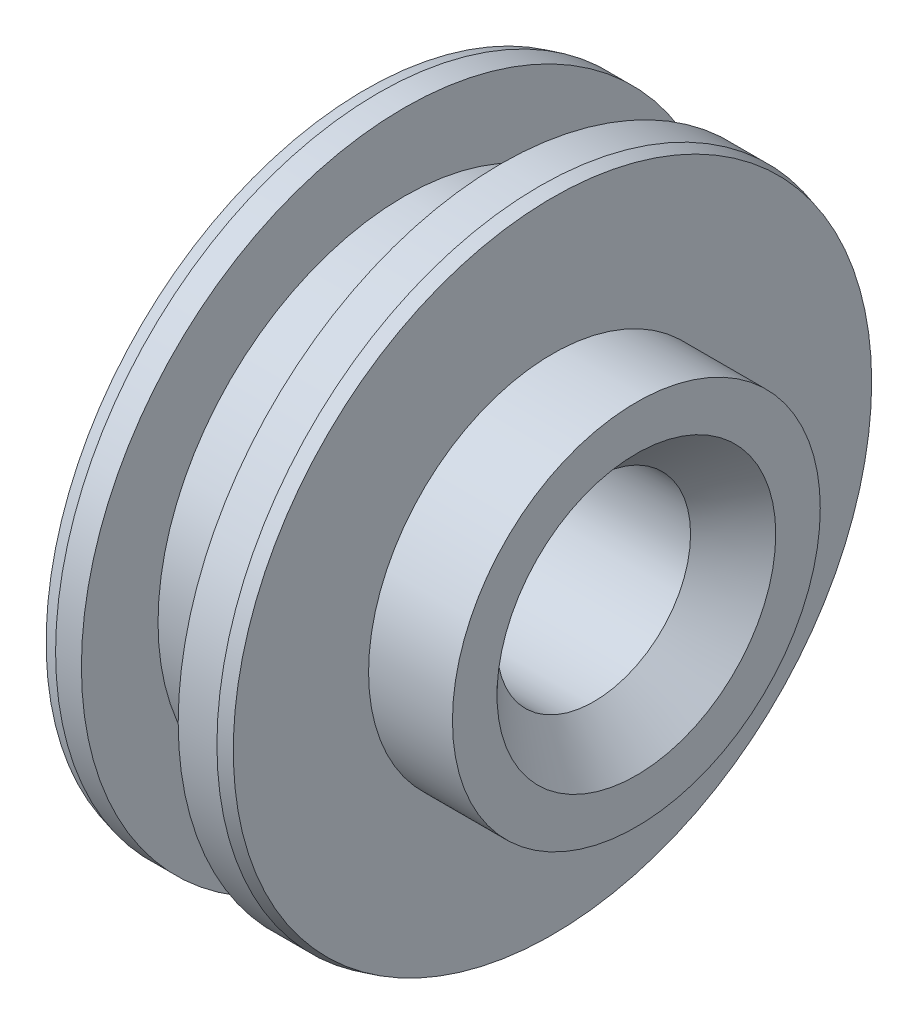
ISO-10303-21;
HEADER;
FILE_DESCRIPTION(('STEP AP214'),'2;1');
FILE_NAME('part.step','',(''),(''),'','','');
FILE_SCHEMA(('AUTOMOTIVE_DESIGN { 1 0 10303 214 1 1 1 1 }'));
ENDSEC;
DATA;
#1=APPLICATION_CONTEXT('core data for automotive mechanical design processes');
#2=APPLICATION_PROTOCOL_DEFINITION('international standard','automotive_design',2000,#1);
#3=PRODUCT_CONTEXT('',#1,'mechanical');
#4=PRODUCT('Part','Part','',(#3));
#5=PRODUCT_RELATED_PRODUCT_CATEGORY('part','',(#4));
#6=PRODUCT_DEFINITION_FORMATION('','',#4);
#7=PRODUCT_DEFINITION_CONTEXT('part definition',#1,'design');
#8=PRODUCT_DEFINITION('design','',#6,#7);
#9=PRODUCT_DEFINITION_SHAPE('','',#8);
#10=(LENGTH_UNIT() NAMED_UNIT(*) SI_UNIT(.MILLI.,.METRE.));
#11=(NAMED_UNIT(*) PLANE_ANGLE_UNIT() SI_UNIT($,.RADIAN.));
#12=(NAMED_UNIT(*) SI_UNIT($,.STERADIAN.) SOLID_ANGLE_UNIT());
#13=UNCERTAINTY_MEASURE_WITH_UNIT(LENGTH_MEASURE(1.E-05),#10,'distance_accuracy_value','');
#14=(GEOMETRIC_REPRESENTATION_CONTEXT(3) GLOBAL_UNCERTAINTY_ASSIGNED_CONTEXT((#13)) GLOBAL_UNIT_ASSIGNED_CONTEXT((#10,
#11,#12)) REPRESENTATION_CONTEXT('',''));
#15=CARTESIAN_POINT('',(0.,0.,0.));
#16=DIRECTION('',(0.,0.,1.));
#17=DIRECTION('',(1.,0.,0.));
#18=AXIS2_PLACEMENT_3D('',#15,#16,#17);
#19=CARTESIAN_POINT('',(0.,0.,0.));
#20=DIRECTION('',(1.,0.,0.));
#21=DIRECTION('',(0.,0.,-1.));
#22=AXIS2_PLACEMENT_3D('',#19,#20,#21);
#23=CYLINDRICAL_SURFACE('',#22,3.);
#24=CARTESIAN_POINT('',(7.08,0.,0.));
#25=DIRECTION('',(1.,0.,0.));
#26=DIRECTION('',(0.,0.,-1.));
#27=AXIS2_PLACEMENT_3D('',#24,#25,#26);
#28=CIRCLE('',#27,3.);
#29=CARTESIAN_POINT('',(7.08,0.,-3.));
#30=VERTEX_POINT('',#29);
#31=EDGE_CURVE('E391',#30,#30,#28,.T.);
#32=ORIENTED_EDGE('',*,*,#31,.T.);
#33=EDGE_LOOP('',(#32));
#34=FACE_BOUND('',#33,.T.);
#35=CARTESIAN_POINT('',(0.,0.,0.));
#36=DIRECTION('',(1.,0.,0.));
#37=DIRECTION('',(0.,0.,-1.));
#38=AXIS2_PLACEMENT_3D('',#35,#36,#37);
#39=CIRCLE('',#38,3.);
#40=CARTESIAN_POINT('',(0.,0.,-3.));
#41=VERTEX_POINT('',#40);
#42=EDGE_CURVE('E10',#41,#41,#39,.T.);
#43=ORIENTED_EDGE('',*,*,#42,.F.);
#44=EDGE_LOOP('',(#43));
#45=FACE_BOUND('',#44,.T.);
#46=ADVANCED_FACE('F348',(#34,#45),#23,.F.);
#47=CARTESIAN_POINT('',(0.,3.,0.));
#48=DIRECTION('',(-1.,0.,0.));
#49=DIRECTION('',(0.,0.,1.));
#50=AXIS2_PLACEMENT_3D('',#47,#48,#49);
#51=PLANE('',#50);
#52=ORIENTED_EDGE('',*,*,#42,.T.);
#53=EDGE_LOOP('',(#52));
#54=FACE_BOUND('',#53,.T.);
#55=CARTESIAN_POINT('',(0.,0.,0.));
#56=DIRECTION('',(1.,0.,0.));
#57=DIRECTION('',(0.,0.,-1.));
#58=AXIS2_PLACEMENT_3D('',#55,#56,#57);
#59=CIRCLE('',#58,9.89282032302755);
#60=CARTESIAN_POINT('',(0.,0.,-9.89282032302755));
#61=VERTEX_POINT('',#60);
#62=EDGE_CURVE('E354',#61,#61,#59,.T.);
#63=ORIENTED_EDGE('',*,*,#62,.F.);
#64=EDGE_LOOP('',(#63));
#65=FACE_BOUND('',#64,.T.);
#66=ADVANCED_FACE('F409',(#54,#65),#51,.T.);
#67=CARTESIAN_POINT('',(0.400000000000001,0.,0.));
#68=DIRECTION('',(1.,0.,0.));
#69=DIRECTION('',(0.,0.,-1.));
#70=AXIS2_PLACEMENT_3D('',#67,#68,#69);
#71=CONICAL_SURFACE('',#70,10.,0.261799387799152);
#72=ORIENTED_EDGE('',*,*,#62,.T.);
#73=EDGE_LOOP('',(#72));
#74=FACE_BOUND('',#73,.T.);
#75=CARTESIAN_POINT('',(0.400000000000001,0.,0.));
#76=DIRECTION('',(1.,0.,0.));
#77=DIRECTION('',(0.,0.,-1.));
#78=AXIS2_PLACEMENT_3D('',#75,#76,#77);
#79=CIRCLE('',#78,10.);
#80=CARTESIAN_POINT('',(0.400000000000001,0.,-10.));
#81=VERTEX_POINT('',#80);
#82=EDGE_CURVE('E358',#81,#81,#79,.T.);
#83=ORIENTED_EDGE('',*,*,#82,.F.);
#84=EDGE_LOOP('',(#83));
#85=FACE_BOUND('',#84,.T.);
#86=ADVANCED_FACE('F413',(#74,#85),#71,.T.);
#87=CARTESIAN_POINT('',(0.,0.,0.));
#88=DIRECTION('',(1.,0.,0.));
#89=DIRECTION('',(0.,0.,-1.));
#90=AXIS2_PLACEMENT_3D('',#87,#88,#89);
#91=CYLINDRICAL_SURFACE('',#90,10.);
#92=ORIENTED_EDGE('',*,*,#82,.T.);
#93=EDGE_LOOP('',(#92));
#94=FACE_BOUND('',#93,.T.);
#95=CARTESIAN_POINT('',(1.2,0.,0.));
#96=DIRECTION('',(1.,0.,0.));
#97=DIRECTION('',(0.,0.,-1.));
#98=AXIS2_PLACEMENT_3D('',#95,#96,#97);
#99=CIRCLE('',#98,10.);
#100=CARTESIAN_POINT('',(1.2,0.,-10.));
#101=VERTEX_POINT('',#100);
#102=EDGE_CURVE('E362',#101,#101,#99,.T.);
#103=ORIENTED_EDGE('',*,*,#102,.F.);
#104=EDGE_LOOP('',(#103));
#105=FACE_BOUND('',#104,.T.);
#106=ADVANCED_FACE('F417',(#94,#105),#91,.T.);
#107=CARTESIAN_POINT('',(1.2,10.,0.));
#108=DIRECTION('',(1.,0.,0.));
#109=DIRECTION('',(0.,0.,-1.));
#110=AXIS2_PLACEMENT_3D('',#107,#108,#109);
#111=PLANE('',#110);
#112=ORIENTED_EDGE('',*,*,#102,.T.);
#113=EDGE_LOOP('',(#112));
#114=FACE_BOUND('',#113,.T.);
#115=CARTESIAN_POINT('',(1.2,0.,0.));
#116=DIRECTION('',(1.,0.,0.));
#117=DIRECTION('',(0.,0.,-1.));
#118=AXIS2_PLACEMENT_3D('',#115,#116,#117);
#119=CIRCLE('',#118,7.625);
#120=CARTESIAN_POINT('',(1.2,0.,-7.625));
#121=VERTEX_POINT('',#120);
#122=EDGE_CURVE('E367',#121,#121,#119,.T.);
#123=ORIENTED_EDGE('',*,*,#122,.F.);
#124=EDGE_LOOP('',(#123));
#125=FACE_BOUND('',#124,.T.);
#126=ADVANCED_FACE('F423',(#114,#125),#111,.T.);
#127=CARTESIAN_POINT('',(0.,0.,0.));
#128=DIRECTION('',(1.,0.,0.));
#129=DIRECTION('',(0.,0.,-1.));
#130=AXIS2_PLACEMENT_3D('',#127,#128,#129);
#131=CYLINDRICAL_SURFACE('',#130,7.625);
#132=ORIENTED_EDGE('',*,*,#122,.T.);
#133=EDGE_LOOP('',(#132));
#134=FACE_BOUND('',#133,.T.);
#135=CARTESIAN_POINT('',(4.2,0.,0.));
#136=DIRECTION('',(1.,0.,0.));
#137=DIRECTION('',(0.,0.,-1.));
#138=AXIS2_PLACEMENT_3D('',#135,#136,#137);
#139=CIRCLE('',#138,7.625);
#140=CARTESIAN_POINT('',(4.2,0.,-7.625));
#141=VERTEX_POINT('',#140);
#142=EDGE_CURVE('E370',#141,#141,#139,.T.);
#143=ORIENTED_EDGE('',*,*,#142,.F.);
#144=EDGE_LOOP('',(#143));
#145=FACE_BOUND('',#144,.T.);
#146=ADVANCED_FACE('F427',(#134,#145),#131,.T.);
#147=CARTESIAN_POINT('',(4.2,7.62499999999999,0.));
#148=DIRECTION('',(-1.,0.,0.));
#149=DIRECTION('',(0.,0.,1.));
#150=AXIS2_PLACEMENT_3D('',#147,#148,#149);
#151=PLANE('',#150);
#152=ORIENTED_EDGE('',*,*,#142,.T.);
#153=EDGE_LOOP('',(#152));
#154=FACE_BOUND('',#153,.T.);
#155=CARTESIAN_POINT('',(4.2,0.,0.));
#156=DIRECTION('',(1.,0.,0.));
#157=DIRECTION('',(0.,0.,-1.));
#158=AXIS2_PLACEMENT_3D('',#155,#156,#157);
#159=CIRCLE('',#158,10.);
#160=CARTESIAN_POINT('',(4.2,0.,-10.));
#161=VERTEX_POINT('',#160);
#162=EDGE_CURVE('E373',#161,#161,#159,.T.);
#163=ORIENTED_EDGE('',*,*,#162,.F.);
#164=EDGE_LOOP('',(#163));
#165=FACE_BOUND('',#164,.T.);
#166=ADVANCED_FACE('F431',(#154,#165),#151,.T.);
#167=CARTESIAN_POINT('',(0.,0.,0.));
#168=DIRECTION('',(1.,0.,0.));
#169=DIRECTION('',(0.,0.,-1.));
#170=AXIS2_PLACEMENT_3D('',#167,#168,#169);
#171=CYLINDRICAL_SURFACE('',#170,10.);
#172=ORIENTED_EDGE('',*,*,#162,.T.);
#173=EDGE_LOOP('',(#172));
#174=FACE_BOUND('',#173,.T.);
#175=CARTESIAN_POINT('',(5.4,0.,0.));
#176=DIRECTION('',(1.,0.,0.));
#177=DIRECTION('',(0.,0.,-1.));
#178=AXIS2_PLACEMENT_3D('',#175,#176,#177);
#179=CIRCLE('',#178,10.);
#180=CARTESIAN_POINT('',(5.4,0.,-10.));
#181=VERTEX_POINT('',#180);
#182=EDGE_CURVE('E376',#181,#181,#179,.T.);
#183=ORIENTED_EDGE('',*,*,#182,.F.);
#184=EDGE_LOOP('',(#183));
#185=FACE_BOUND('',#184,.T.);
#186=ADVANCED_FACE('F435',(#174,#185),#171,.T.);
#187=CARTESIAN_POINT('',(5.8,0.,0.));
#188=DIRECTION('',(-1.,0.,0.));
#189=DIRECTION('',(0.,0.,1.));
#190=AXIS2_PLACEMENT_3D('',#187,#188,#189);
#191=CONICAL_SURFACE('',#190,9.89282032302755,0.26179938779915);
#192=ORIENTED_EDGE('',*,*,#182,.T.);
#193=EDGE_LOOP('',(#192));
#194=FACE_BOUND('',#193,.T.);
#195=CARTESIAN_POINT('',(5.8,0.,0.));
#196=DIRECTION('',(1.,0.,0.));
#197=DIRECTION('',(0.,0.,-1.));
#198=AXIS2_PLACEMENT_3D('',#195,#196,#197);
#199=CIRCLE('',#198,9.89282032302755);
#200=CARTESIAN_POINT('',(5.8,0.,-9.89282032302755));
#201=VERTEX_POINT('',#200);
#202=EDGE_CURVE('E379',#201,#201,#199,.T.);
#203=ORIENTED_EDGE('',*,*,#202,.F.);
#204=EDGE_LOOP('',(#203));
#205=FACE_BOUND('',#204,.T.);
#206=ADVANCED_FACE('F439',(#194,#205),#191,.T.);
#207=CARTESIAN_POINT('',(5.80000000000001,9.89282032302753,0.));
#208=DIRECTION('',(1.,0.,0.));
#209=DIRECTION('',(0.,0.,-1.));
#210=AXIS2_PLACEMENT_3D('',#207,#208,#209);
#211=PLANE('',#210);
#212=ORIENTED_EDGE('',*,*,#202,.T.);
#213=EDGE_LOOP('',(#212));
#214=FACE_BOUND('',#213,.T.);
#215=CARTESIAN_POINT('',(5.8,0.,0.));
#216=DIRECTION('',(1.,0.,0.));
#217=DIRECTION('',(0.,0.,-1.));
#218=AXIS2_PLACEMENT_3D('',#215,#216,#217);
#219=CIRCLE('',#218,5.7);
#220=CARTESIAN_POINT('',(5.8,0.,-5.7));
#221=VERTEX_POINT('',#220);
#222=EDGE_CURVE('E382',#221,#221,#219,.T.);
#223=ORIENTED_EDGE('',*,*,#222,.F.);
#224=EDGE_LOOP('',(#223));
#225=FACE_BOUND('',#224,.T.);
#226=ADVANCED_FACE('F443',(#214,#225),#211,.T.);
#227=CARTESIAN_POINT('',(0.,0.,0.));
#228=DIRECTION('',(1.,0.,0.));
#229=DIRECTION('',(0.,0.,-1.));
#230=AXIS2_PLACEMENT_3D('',#227,#228,#229);
#231=CYLINDRICAL_SURFACE('',#230,5.7);
#232=ORIENTED_EDGE('',*,*,#222,.T.);
#233=EDGE_LOOP('',(#232));
#234=FACE_BOUND('',#233,.T.);
#235=CARTESIAN_POINT('',(8.4,0.,0.));
#236=DIRECTION('',(1.,0.,0.));
#237=DIRECTION('',(0.,0.,-1.));
#238=AXIS2_PLACEMENT_3D('',#235,#236,#237);
#239=CIRCLE('',#238,5.7);
#240=CARTESIAN_POINT('',(8.4,0.,-5.7));
#241=VERTEX_POINT('',#240);
#242=EDGE_CURVE('E385',#241,#241,#239,.T.);
#243=ORIENTED_EDGE('',*,*,#242,.F.);
#244=EDGE_LOOP('',(#243));
#245=FACE_BOUND('',#244,.T.);
#246=ADVANCED_FACE('F405',(#234,#245),#231,.T.);
#247=CARTESIAN_POINT('',(8.4,5.69999999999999,0.));
#248=DIRECTION('',(1.,0.,0.));
#249=DIRECTION('',(0.,0.,-1.));
#250=AXIS2_PLACEMENT_3D('',#247,#248,#249);
#251=PLANE('',#250);
#252=ORIENTED_EDGE('',*,*,#242,.T.);
#253=EDGE_LOOP('',(#252));
#254=FACE_BOUND('',#253,.T.);
#255=CARTESIAN_POINT('',(8.4,0.,0.));
#256=DIRECTION('',(1.,0.,0.));
#257=DIRECTION('',(0.,0.,-1.));
#258=AXIS2_PLACEMENT_3D('',#255,#256,#257);
#259=CIRCLE('',#258,4.31999999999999);
#260=CARTESIAN_POINT('',(8.4,0.,-4.31999999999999));
#261=VERTEX_POINT('',#260);
#262=EDGE_CURVE('E388',#261,#261,#259,.T.);
#263=ORIENTED_EDGE('',*,*,#262,.F.);
#264=EDGE_LOOP('',(#263));
#265=FACE_BOUND('',#264,.T.);
#266=ADVANCED_FACE('F399',(#254,#265),#251,.T.);
#267=CARTESIAN_POINT('',(7.08,0.,0.));
#268=DIRECTION('',(1.,0.,0.));
#269=DIRECTION('',(0.,0.,-1.));
#270=AXIS2_PLACEMENT_3D('',#267,#268,#269);
#271=CONICAL_SURFACE('',#270,3.,0.785398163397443);
#272=ORIENTED_EDGE('',*,*,#262,.T.);
#273=EDGE_LOOP('',(#272));
#274=FACE_BOUND('',#273,.T.);
#275=ORIENTED_EDGE('',*,*,#31,.F.);
#276=EDGE_LOOP('',(#275));
#277=FACE_BOUND('',#276,.T.);
#278=ADVANCED_FACE('F397',(#274,#277),#271,.F.);
#279=CLOSED_SHELL('',(#46,#66,#86,#106,#126,#146,#166,#186,#206,#226,#246,#266,#278));
#280=MANIFOLD_SOLID_BREP('B2',#279);
#281=ADVANCED_BREP_SHAPE_REPRESENTATION('',(#18,#280),#14);
#282=SHAPE_DEFINITION_REPRESENTATION(#9,#281);
ENDSEC;
END-ISO-10303-21;
